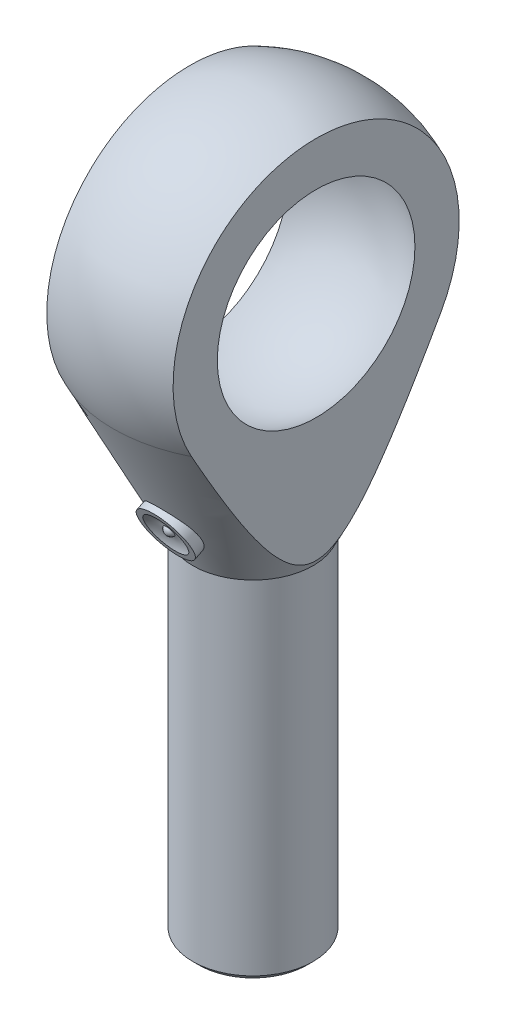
ISO-10303-21;
HEADER;
FILE_DESCRIPTION(('STEP AP214'),'2;1');
FILE_NAME('part.step','',(''),(''),'','','');
FILE_SCHEMA(('AUTOMOTIVE_DESIGN { 1 0 10303 214 1 1 1 1 }'));
ENDSEC;
DATA;
#1=APPLICATION_CONTEXT('core data for automotive mechanical design processes');
#2=APPLICATION_PROTOCOL_DEFINITION('international standard','automotive_design',2000,#1);
#3=PRODUCT_CONTEXT('',#1,'mechanical');
#4=PRODUCT('Part','Part','',(#3));
#5=PRODUCT_RELATED_PRODUCT_CATEGORY('part','',(#4));
#6=PRODUCT_DEFINITION_FORMATION('','',#4);
#7=PRODUCT_DEFINITION_CONTEXT('part definition',#1,'design');
#8=PRODUCT_DEFINITION('design','',#6,#7);
#9=PRODUCT_DEFINITION_SHAPE('','',#8);
#10=(LENGTH_UNIT() NAMED_UNIT(*) SI_UNIT(.MILLI.,.METRE.));
#11=(NAMED_UNIT(*) PLANE_ANGLE_UNIT() SI_UNIT($,.RADIAN.));
#12=(NAMED_UNIT(*) SI_UNIT($,.STERADIAN.) SOLID_ANGLE_UNIT());
#13=UNCERTAINTY_MEASURE_WITH_UNIT(LENGTH_MEASURE(1.E-05),#10,'distance_accuracy_value','');
#14=(GEOMETRIC_REPRESENTATION_CONTEXT(3) GLOBAL_UNCERTAINTY_ASSIGNED_CONTEXT((#13)) GLOBAL_UNIT_ASSIGNED_CONTEXT((#10,
#11,#12)) REPRESENTATION_CONTEXT('',''));
#15=CARTESIAN_POINT('',(0.,0.,0.));
#16=DIRECTION('',(0.,0.,1.));
#17=DIRECTION('',(1.,0.,0.));
#18=AXIS2_PLACEMENT_3D('',#15,#16,#17);
#19=CARTESIAN_POINT('',(0.,-19.,0.));
#20=DIRECTION('',(0.,1.,0.));
#21=DIRECTION('',(0.,0.,1.));
#22=AXIS2_PLACEMENT_3D('',#19,#20,#21);
#23=CONICAL_SURFACE('',#22,5.,0.465736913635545);
#24=CARTESIAN_POINT('',(-5.25,34.8684426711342,-31.6424798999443));
#25=CARTESIAN_POINT('',(-5.25,33.2094426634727,-30.7972062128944));
#26=CARTESIAN_POINT('',(-5.25,31.5507803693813,-29.951268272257));
#27=CARTESIAN_POINT('',(-5.25,28.2343943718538,-28.2575243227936));
#28=CARTESIAN_POINT('',(-5.25,26.5766706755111,-27.4097183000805));
#29=CARTESIAN_POINT('',(-5.25,23.2617657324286,-25.7113607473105));
#30=CARTESIAN_POINT('',(-5.25,21.6045849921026,-24.8608082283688));
#31=CARTESIAN_POINT('',(-5.25,18.2919007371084,-23.1564653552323));
#32=CARTESIAN_POINT('',(-5.25,16.6363972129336,-22.3026750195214));
#33=CARTESIAN_POINT('',(-5.25,13.3591181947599,-20.6068440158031));
#34=CARTESIAN_POINT('',(-5.25,11.7372989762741,-19.7648879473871));
#35=CARTESIAN_POINT('',(-5.25,9.30701714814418,-18.4972267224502));
#36=CARTESIAN_POINT('',(-5.25,8.49732379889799,-18.0738813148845));
#37=CARTESIAN_POINT('',(-5.25,6.87895683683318,-17.2252463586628));
#38=CARTESIAN_POINT('',(-5.25,6.07028322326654,-16.7999568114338));
#39=CARTESIAN_POINT('',(-5.25,4.45441052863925,-15.947068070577));
#40=CARTESIAN_POINT('',(-5.25,3.64721113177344,-15.5194694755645));
#41=CARTESIAN_POINT('',(-5.25,2.03444060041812,-14.6612141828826));
#42=CARTESIAN_POINT('',(-5.25,1.22886946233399,-14.230557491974));
#43=CARTESIAN_POINT('',(-5.25,-0.380121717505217,-13.3652946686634));
#44=CARTESIAN_POINT('',(-5.25,-1.18354181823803,-12.9306886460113));
#45=CARTESIAN_POINT('',(-5.25,-2.78751936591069,-12.0562300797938));
#46=CARTESIAN_POINT('',(-5.25,-3.58807683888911,-11.6163775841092));
#47=CARTESIAN_POINT('',(-5.25,-4.75989727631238,-10.9656125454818));
#48=CARTESIAN_POINT('',(-5.25,-5.13273040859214,-10.7575271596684));
#49=CARTESIAN_POINT('',(-5.25,-5.87734752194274,-10.3394833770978));
#50=CARTESIAN_POINT('',(-5.25,-6.24913149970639,-10.1295249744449));
#51=CARTESIAN_POINT('',(-5.25,-6.99154138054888,-9.70732959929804));
#52=CARTESIAN_POINT('',(-5.25,-7.3621669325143,-9.49509200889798));
#53=CARTESIAN_POINT('',(-5.25,-8.10187662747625,-9.06794841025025));
#54=CARTESIAN_POINT('',(-5.25,-8.4709607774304,-8.85304241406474));
#55=CARTESIAN_POINT('',(-5.25,-9.21045644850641,-8.41807751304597));
#56=CARTESIAN_POINT('',(-5.25,-9.58085111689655,-8.19798991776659));
#57=CARTESIAN_POINT('',(-5.25,-10.3191771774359,-7.75372123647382));
#58=CARTESIAN_POINT('',(-5.25,-10.6871085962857,-7.52954019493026));
#59=CARTESIAN_POINT('',(-5.25,-11.4195455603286,-7.0761504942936));
#60=CARTESIAN_POINT('',(-5.25,-11.7840531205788,-6.84694509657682));
#61=CARTESIAN_POINT('',(-5.25,-12.5088011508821,-6.38189138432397));
#62=CARTESIAN_POINT('',(-5.25,-12.8690418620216,-6.14604344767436));
#63=CARTESIAN_POINT('',(-5.25,-13.4171978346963,-5.77739604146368));
#64=CARTESIAN_POINT('',(-5.25,-13.6072378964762,-5.64775635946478));
#65=CARTESIAN_POINT('',(-5.25,-13.9852402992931,-5.38548642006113));
#66=CARTESIAN_POINT('',(-5.25,-14.1732026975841,-5.25285624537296));
#67=CARTESIAN_POINT('',(-5.25,-14.5468858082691,-4.98380606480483));
#68=CARTESIAN_POINT('',(-5.25,-14.7326021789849,-4.84738001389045));
#69=CARTESIAN_POINT('',(-5.25,-15.1007882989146,-4.57022584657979));
#70=CARTESIAN_POINT('',(-5.25,-15.2832582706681,-4.42949802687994));
#71=CARTESIAN_POINT('',(-5.25,-15.6422165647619,-4.14421618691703));
#72=CARTESIAN_POINT('',(-5.25,-15.8187465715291,-3.99971483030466));
#73=CARTESIAN_POINT('',(-5.25,-16.1664748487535,-3.70427773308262));
#74=CARTESIAN_POINT('',(-5.25,-16.3376713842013,-3.55333993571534));
#75=CARTESIAN_POINT('',(-5.25,-16.6722335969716,-3.24389491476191));
#76=CARTESIAN_POINT('',(-5.25,-16.8356199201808,-3.08541014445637));
#77=CARTESIAN_POINT('',(-5.25,-17.1519941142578,-2.75844697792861));
#78=CARTESIAN_POINT('',(-5.25,-17.3049907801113,-2.58997726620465));
#79=CARTESIAN_POINT('',(-5.25,-17.5152880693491,-2.33703604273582));
#80=CARTESIAN_POINT('',(-5.25,-17.5787096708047,-2.25764863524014));
#81=CARTESIAN_POINT('',(-5.25,-17.7018702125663,-2.09603810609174));
#82=CARTESIAN_POINT('',(-5.25,-17.7616086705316,-2.01381461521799));
#83=CARTESIAN_POINT('',(-5.25,-17.8767285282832,-1.84612002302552));
#84=CARTESIAN_POINT('',(-5.25,-17.9321019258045,-1.7606433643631));
#85=CARTESIAN_POINT('',(-5.25,-18.0373835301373,-1.586425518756));
#86=CARTESIAN_POINT('',(-5.25,-18.0872915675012,-1.49768423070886));
#87=CARTESIAN_POINT('',(-5.25,-18.228682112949,-1.22311710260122));
#88=CARTESIAN_POINT('',(-5.25,-18.309929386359,-1.03159315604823));
#89=CARTESIAN_POINT('',(-5.25,-18.4023527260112,-0.735584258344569));
#90=CARTESIAN_POINT('',(-5.25,-18.4282366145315,-0.635608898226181));
#91=CARTESIAN_POINT('',(-5.25,-18.4689732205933,-0.433403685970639));
#92=CARTESIAN_POINT('',(-5.25,-18.483829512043,-0.331174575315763));
#93=CARTESIAN_POINT('',(-5.25,-18.5005113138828,-0.138345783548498));
#94=CARTESIAN_POINT('',(-5.25,-18.5037159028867,-0.0478638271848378));
#95=CARTESIAN_POINT('',(-5.25,-18.5007998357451,0.132943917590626));
#96=CARTESIAN_POINT('',(-5.25,-18.4946799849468,0.223269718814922));
#97=CARTESIAN_POINT('',(-5.25,-18.4733972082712,0.402982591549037));
#98=CARTESIAN_POINT('',(-5.25,-18.4582201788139,0.492367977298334));
#99=CARTESIAN_POINT('',(-5.25,-18.4195200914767,0.669288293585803));
#100=CARTESIAN_POINT('',(-5.25,-18.3959954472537,0.756822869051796));
#101=CARTESIAN_POINT('',(-5.25,-18.3035909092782,1.04963639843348));
#102=CARTESIAN_POINT('',(-5.25,-18.2171126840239,1.2494952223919));
#103=CARTESIAN_POINT('',(-5.25,-18.0656290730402,1.53720309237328));
#104=CARTESIAN_POINT('',(-5.25,-18.0114085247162,1.63122497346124));
#105=CARTESIAN_POINT('',(-5.25,-17.8969897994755,1.81559205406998));
#106=CARTESIAN_POINT('',(-5.25,-17.83679228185,1.90593765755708));
#107=CARTESIAN_POINT('',(-5.25,-17.689038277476,2.11505617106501));
#108=CARTESIAN_POINT('',(-5.25,-17.5994289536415,2.23236605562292));
#109=CARTESIAN_POINT('',(-5.25,-17.4133884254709,2.4614833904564));
#110=CARTESIAN_POINT('',(-5.25,-17.3169539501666,2.57328815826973));
#111=CARTESIAN_POINT('',(-5.25,-17.1186654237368,2.79231361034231));
#112=CARTESIAN_POINT('',(-5.25,-17.0168020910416,2.89952583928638));
#113=CARTESIAN_POINT('',(-5.25,-16.8089315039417,3.10986043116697));
#114=CARTESIAN_POINT('',(-5.25,-16.7029237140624,3.21298226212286));
#115=CARTESIAN_POINT('',(-5.25,-16.4868365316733,3.41643433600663));
#116=CARTESIAN_POINT('',(-5.25,-16.3767333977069,3.51673926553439));
#117=CARTESIAN_POINT('',(-5.25,-16.153811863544,3.71428260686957));
#118=CARTESIAN_POINT('',(-5.25,-16.0409933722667,3.81152091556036));
#119=CARTESIAN_POINT('',(-5.25,-15.813265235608,4.00322768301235));
#120=CARTESIAN_POINT('',(-5.25,-15.6983582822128,4.09769934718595));
#121=CARTESIAN_POINT('',(-5.25,-15.4666941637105,4.28433125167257));
#122=CARTESIAN_POINT('',(-5.25,-15.3499370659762,4.37649157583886));
#123=CARTESIAN_POINT('',(-5.25,-14.9700451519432,4.67112941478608));
#124=CARTESIAN_POINT('',(-5.25,-14.7038123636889,4.86961583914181));
#125=CARTESIAN_POINT('',(-5.25,-14.1658690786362,5.25904523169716));
#126=CARTESIAN_POINT('',(-5.25,-13.89415771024,5.44998698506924));
#127=CARTESIAN_POINT('',(-5.25,-13.3465605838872,5.82606562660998));
#128=CARTESIAN_POINT('',(-5.25,-13.0706728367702,6.01119961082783));
#129=CARTESIAN_POINT('',(-5.25,-12.5158071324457,6.37678065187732));
#130=CARTESIAN_POINT('',(-5.25,-12.2368290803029,6.55722756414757));
#131=CARTESIAN_POINT('',(-5.25,-11.6758942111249,6.91468303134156));
#132=CARTESIAN_POINT('',(-5.25,-11.3939325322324,7.09168394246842));
#133=CARTESIAN_POINT('',(-5.25,-10.8280628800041,7.44254904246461));
#134=CARTESIAN_POINT('',(-5.25,-10.5441548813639,7.61641319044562));
#135=CARTESIAN_POINT('',(-5.25,-9.69024876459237,8.13400773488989));
#136=CARTESIAN_POINT('',(-5.25,-9.11789444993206,8.47385013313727));
#137=CARTESIAN_POINT('',(-5.25,-7.97004092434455,9.145428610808));
#138=CARTESIAN_POINT('',(-5.25,-7.39455053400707,9.47717984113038));
#139=CARTESIAN_POINT('',(-5.25,-6.24038506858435,10.1351838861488));
#140=CARTESIAN_POINT('',(-5.25,-5.66170977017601,10.4614363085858));
#141=CARTESIAN_POINT('',(-5.25,-4.50269693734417,11.1093171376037));
#142=CARTESIAN_POINT('',(-5.25,-3.92236225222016,11.4309506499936));
#143=CARTESIAN_POINT('',(-5.25,-2.75988076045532,12.0708885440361));
#144=CARTESIAN_POINT('',(-5.25,-2.17773399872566,12.3891930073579));
#145=CARTESIAN_POINT('',(-5.25,-0.629376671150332,13.2312444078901));
#146=CARTESIAN_POINT('',(-5.25,0.338086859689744,13.752686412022));
#147=CARTESIAN_POINT('',(-5.25,2.27578641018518,14.7903974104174));
#148=CARTESIAN_POINT('',(-5.25,3.2460224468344,15.3066663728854));
#149=CARTESIAN_POINT('',(-5.25,5.18855936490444,16.3353643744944));
#150=CARTESIAN_POINT('',(-5.25,6.16086029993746,16.8477933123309));
#151=CARTESIAN_POINT('',(-5.25,8.10700681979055,17.8697100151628));
#152=CARTESIAN_POINT('',(-5.25,9.08085240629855,18.3791977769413));
#153=CARTESIAN_POINT('',(-5.25,11.0303341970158,19.3961831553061));
#154=CARTESIAN_POINT('',(-5.25,12.0059711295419,19.9036793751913));
#155=CARTESIAN_POINT('',(-5.25,13.9581986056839,20.9168348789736));
#156=CARTESIAN_POINT('',(-5.25,14.9347891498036,21.4224941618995));
#157=CARTESIAN_POINT('',(-5.25,17.8656758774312,22.9372460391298));
#158=CARTESIAN_POINT('',(-5.25,19.8211149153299,23.9441271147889));
#159=CARTESIAN_POINT('',(-5.25,23.7151250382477,25.9441629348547));
#160=CARTESIAN_POINT('',(-5.25,25.6536763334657,26.9373562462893));
#161=CARTESIAN_POINT('',(-5.25,29.532235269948,28.9209160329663));
#162=CARTESIAN_POINT('',(-5.25,31.4722429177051,29.9112824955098));
#163=CARTESIAN_POINT('',(-5.25,35.3519314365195,31.889216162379));
#164=CARTESIAN_POINT('',(-5.25,37.2916115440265,32.8767848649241));
#165=CARTESIAN_POINT('',(-5.25,41.1717855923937,34.8502960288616));
#166=CARTESIAN_POINT('',(-5.25,43.1122795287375,35.8362384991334));
#167=CARTESIAN_POINT('',(-5.25,45.0530661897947,36.8216034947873));
#168=B_SPLINE_CURVE_WITH_KNOTS('',3,(#24,#25,#26,#27,#28,#29,#30,#31,#32,#33,#34,#35,#36,#37,
#38,#39,#40,#41,#42,#43,#44,#45,#46,#47,#48,#49,#50,#51,#52,#53,#54,#55,#56,#57,#58,#59,#60,#61,
#62,#63,#64,#65,#66,#67,#68,#69,#70,#71,#72,#73,#74,#75,#76,#77,#78,#79,#80,#81,#82,#83,#84,#85,
#86,#87,#88,#89,#90,#91,#92,#93,#94,#95,#96,#97,#98,#99,#100,#101,#102,#103,#104,#105,#106,#107,
#108,#109,#110,#111,#112,#113,#114,#115,#116,#117,#118,#119,#120,#121,#122,#123,#124,#125,#126,
#127,#128,#129,#130,#131,#132,#133,#134,#135,#136,#137,#138,#139,#140,#141,#142,#143,#144,#145,
#146,#147,#148,#149,#150,#151,#152,#153,#154,#155,#156,#157,#158,#159,#160,#161,#162,#163,#164,
#165,#166,#167),.UNSPECIFIED.,.F.,.F.,(4,2,2,2,2,2,2,2,2,2,2,2,2,2,2,2,2,2,2,2,2,2,2,2,2,2,2,2,
2,2,2,2,2,2,2,2,2,2,2,2,2,2,2,2,2,2,2,2,2,2,2,2,2,2,2,2,2,2,2,2,2,2,2,2,2,2,2,2,2,2,2,4),(0.,
5.58577897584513,11.1715996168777,16.7597261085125,22.347820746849,27.8298429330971,
30.5709031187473,33.3119612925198,36.0523400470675,38.7927127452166,41.5330095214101,
44.2732813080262,45.5541895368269,46.8351017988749,48.1163705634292,49.3976335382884,
50.6901596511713,51.9826717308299,53.2743683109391,54.5659915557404,55.2561104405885,
55.9462102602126,56.6374802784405,57.3287027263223,58.0129787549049,58.6974751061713,
59.3800487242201,60.0620371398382,60.3667823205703,60.6715673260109,60.9768986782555,
61.2822394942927,61.9026265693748,62.2119430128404,62.5211591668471,62.7923069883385,
63.0634313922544,63.334979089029,63.6065784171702,64.2556127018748,64.581113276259,
64.9065779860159,65.3491038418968,65.7918432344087,66.2353654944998,66.6789452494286,
67.1257050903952,67.572479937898,68.0187148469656,68.4649335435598,69.4609651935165,
70.4571565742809,71.4538383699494,72.450550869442,73.4492676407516,74.4479974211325,
76.4448394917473,78.4375995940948,80.4305012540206,82.4209975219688,84.4114448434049,
87.7085380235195,91.0056514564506,94.3028515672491,97.6000552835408,100.899261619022,
104.198469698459,110.796791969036,117.331292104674,123.865821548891,130.395664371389,
136.925471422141),.UNSPECIFIED.);
#169=CARTESIAN_POINT('',(-5.25,-5.83805753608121,-10.3612057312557));
#170=VERTEX_POINT('',#169);
#171=CARTESIAN_POINT('',(-5.25,-5.83805753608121,10.3612057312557));
#172=VERTEX_POINT('',#171);
#173=EDGE_CURVE('E58',#170,#172,#168,.T.);
#174=ORIENTED_EDGE('',*,*,#173,.F.);
#175=CARTESIAN_POINT('',(0.,-5.83805753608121,0.));
#176=DIRECTION('',(0.,1.,0.));
#177=DIRECTION('',(0.,0.,1.));
#178=AXIS2_PLACEMENT_3D('',#175,#176,#177);
#179=CIRCLE('',#178,11.6153813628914);
#180=CARTESIAN_POINT('',(5.25,-5.83805753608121,-10.3612057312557));
#181=VERTEX_POINT('',#180);
#182=EDGE_CURVE('E66',#181,#170,#179,.T.);
#183=ORIENTED_EDGE('',*,*,#182,.F.);
#184=CARTESIAN_POINT('',(5.25,34.8684426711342,-31.6424798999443));
#185=CARTESIAN_POINT('',(5.25,33.2094426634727,-30.7972062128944));
#186=CARTESIAN_POINT('',(5.25,31.5507803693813,-29.951268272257));
#187=CARTESIAN_POINT('',(5.25,28.2343943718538,-28.2575243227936));
#188=CARTESIAN_POINT('',(5.25,26.5766706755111,-27.4097183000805));
#189=CARTESIAN_POINT('',(5.25,23.2617657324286,-25.7113607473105));
#190=CARTESIAN_POINT('',(5.25,21.6045849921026,-24.8608082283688));
#191=CARTESIAN_POINT('',(5.25,18.2919007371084,-23.1564653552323));
#192=CARTESIAN_POINT('',(5.25,16.6363972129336,-22.3026750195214));
#193=CARTESIAN_POINT('',(5.25,13.3591181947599,-20.6068440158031));
#194=CARTESIAN_POINT('',(5.25,11.7372989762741,-19.7648879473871));
#195=CARTESIAN_POINT('',(5.25,9.30701714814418,-18.4972267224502));
#196=CARTESIAN_POINT('',(5.25,8.49732379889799,-18.0738813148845));
#197=CARTESIAN_POINT('',(5.25,6.87895683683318,-17.2252463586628));
#198=CARTESIAN_POINT('',(5.25,6.07028322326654,-16.7999568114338));
#199=CARTESIAN_POINT('',(5.25,4.45441052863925,-15.947068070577));
#200=CARTESIAN_POINT('',(5.25,3.64721113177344,-15.5194694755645));
#201=CARTESIAN_POINT('',(5.25,2.03444060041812,-14.6612141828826));
#202=CARTESIAN_POINT('',(5.25,1.22886946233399,-14.230557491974));
#203=CARTESIAN_POINT('',(5.25,-0.380121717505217,-13.3652946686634));
#204=CARTESIAN_POINT('',(5.25,-1.18354181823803,-12.9306886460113));
#205=CARTESIAN_POINT('',(5.25,-2.78751936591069,-12.0562300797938));
#206=CARTESIAN_POINT('',(5.25,-3.58807683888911,-11.6163775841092));
#207=CARTESIAN_POINT('',(5.25,-4.75989727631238,-10.9656125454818));
#208=CARTESIAN_POINT('',(5.25,-5.13273040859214,-10.7575271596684));
#209=CARTESIAN_POINT('',(5.25,-5.87734752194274,-10.3394833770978));
#210=CARTESIAN_POINT('',(5.25,-6.24913149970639,-10.1295249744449));
#211=CARTESIAN_POINT('',(5.25,-6.99154138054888,-9.70732959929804));
#212=CARTESIAN_POINT('',(5.25,-7.3621669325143,-9.49509200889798));
#213=CARTESIAN_POINT('',(5.25,-8.10187662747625,-9.06794841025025));
#214=CARTESIAN_POINT('',(5.25,-8.4709607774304,-8.85304241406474));
#215=CARTESIAN_POINT('',(5.25,-9.21045644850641,-8.41807751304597));
#216=CARTESIAN_POINT('',(5.25,-9.58085111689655,-8.19798991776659));
#217=CARTESIAN_POINT('',(5.25,-10.3191771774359,-7.75372123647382));
#218=CARTESIAN_POINT('',(5.25,-10.6871085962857,-7.52954019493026));
#219=CARTESIAN_POINT('',(5.25,-11.4195455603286,-7.0761504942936));
#220=CARTESIAN_POINT('',(5.25,-11.7840531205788,-6.84694509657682));
#221=CARTESIAN_POINT('',(5.25,-12.5088011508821,-6.38189138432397));
#222=CARTESIAN_POINT('',(5.25,-12.8690418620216,-6.14604344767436));
#223=CARTESIAN_POINT('',(5.25,-13.4171978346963,-5.77739604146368));
#224=CARTESIAN_POINT('',(5.25,-13.6072378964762,-5.64775635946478));
#225=CARTESIAN_POINT('',(5.25,-13.9852402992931,-5.38548642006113));
#226=CARTESIAN_POINT('',(5.25,-14.1732026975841,-5.25285624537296));
#227=CARTESIAN_POINT('',(5.25,-14.5468858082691,-4.98380606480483));
#228=CARTESIAN_POINT('',(5.25,-14.7326021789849,-4.84738001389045));
#229=CARTESIAN_POINT('',(5.25,-15.1007882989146,-4.57022584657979));
#230=CARTESIAN_POINT('',(5.25,-15.2832582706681,-4.42949802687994));
#231=CARTESIAN_POINT('',(5.25,-15.6422165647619,-4.14421618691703));
#232=CARTESIAN_POINT('',(5.25,-15.8187465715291,-3.99971483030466));
#233=CARTESIAN_POINT('',(5.25,-16.1664748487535,-3.70427773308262));
#234=CARTESIAN_POINT('',(5.25,-16.3376713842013,-3.55333993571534));
#235=CARTESIAN_POINT('',(5.25,-16.6722335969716,-3.24389491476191));
#236=CARTESIAN_POINT('',(5.25,-16.8356199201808,-3.08541014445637));
#237=CARTESIAN_POINT('',(5.25,-17.1519941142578,-2.75844697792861));
#238=CARTESIAN_POINT('',(5.25,-17.3049907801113,-2.58997726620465));
#239=CARTESIAN_POINT('',(5.25,-17.5152880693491,-2.33703604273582));
#240=CARTESIAN_POINT('',(5.25,-17.5787096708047,-2.25764863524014));
#241=CARTESIAN_POINT('',(5.25,-17.7018702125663,-2.09603810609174));
#242=CARTESIAN_POINT('',(5.25,-17.7616086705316,-2.01381461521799));
#243=CARTESIAN_POINT('',(5.25,-17.8767285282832,-1.84612002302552));
#244=CARTESIAN_POINT('',(5.25,-17.9321019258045,-1.7606433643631));
#245=CARTESIAN_POINT('',(5.25,-18.0373835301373,-1.586425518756));
#246=CARTESIAN_POINT('',(5.25,-18.0872915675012,-1.49768423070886));
#247=CARTESIAN_POINT('',(5.25,-18.228682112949,-1.22311710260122));
#248=CARTESIAN_POINT('',(5.25,-18.309929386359,-1.03159315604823));
#249=CARTESIAN_POINT('',(5.25,-18.4023527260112,-0.735584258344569));
#250=CARTESIAN_POINT('',(5.25,-18.4282366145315,-0.635608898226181));
#251=CARTESIAN_POINT('',(5.25,-18.4689732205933,-0.433403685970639));
#252=CARTESIAN_POINT('',(5.25,-18.483829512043,-0.331174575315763));
#253=CARTESIAN_POINT('',(5.25,-18.5005113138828,-0.138345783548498));
#254=CARTESIAN_POINT('',(5.25,-18.5037159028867,-0.0478638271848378));
#255=CARTESIAN_POINT('',(5.25,-18.5007998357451,0.132943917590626));
#256=CARTESIAN_POINT('',(5.25,-18.4946799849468,0.223269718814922));
#257=CARTESIAN_POINT('',(5.25,-18.4733972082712,0.402982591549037));
#258=CARTESIAN_POINT('',(5.25,-18.4582201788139,0.492367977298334));
#259=CARTESIAN_POINT('',(5.25,-18.4195200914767,0.669288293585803));
#260=CARTESIAN_POINT('',(5.25,-18.3959954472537,0.756822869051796));
#261=CARTESIAN_POINT('',(5.25,-18.3035909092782,1.04963639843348));
#262=CARTESIAN_POINT('',(5.25,-18.2171126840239,1.2494952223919));
#263=CARTESIAN_POINT('',(5.25,-18.0656290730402,1.53720309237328));
#264=CARTESIAN_POINT('',(5.25,-18.0114085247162,1.63122497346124));
#265=CARTESIAN_POINT('',(5.25,-17.8969897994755,1.81559205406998));
#266=CARTESIAN_POINT('',(5.25,-17.83679228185,1.90593765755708));
#267=CARTESIAN_POINT('',(5.25,-17.689038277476,2.11505617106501));
#268=CARTESIAN_POINT('',(5.25,-17.5994289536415,2.23236605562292));
#269=CARTESIAN_POINT('',(5.25,-17.4133884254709,2.4614833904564));
#270=CARTESIAN_POINT('',(5.25,-17.3169539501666,2.57328815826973));
#271=CARTESIAN_POINT('',(5.25,-17.1186654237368,2.79231361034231));
#272=CARTESIAN_POINT('',(5.25,-17.0168020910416,2.89952583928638));
#273=CARTESIAN_POINT('',(5.25,-16.8089315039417,3.10986043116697));
#274=CARTESIAN_POINT('',(5.25,-16.7029237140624,3.21298226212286));
#275=CARTESIAN_POINT('',(5.25,-16.4868365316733,3.41643433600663));
#276=CARTESIAN_POINT('',(5.25,-16.3767333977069,3.51673926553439));
#277=CARTESIAN_POINT('',(5.25,-16.153811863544,3.71428260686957));
#278=CARTESIAN_POINT('',(5.25,-16.0409933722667,3.81152091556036));
#279=CARTESIAN_POINT('',(5.25,-15.813265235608,4.00322768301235));
#280=CARTESIAN_POINT('',(5.25,-15.6983582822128,4.09769934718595));
#281=CARTESIAN_POINT('',(5.25,-15.4666941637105,4.28433125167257));
#282=CARTESIAN_POINT('',(5.25,-15.3499370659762,4.37649157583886));
#283=CARTESIAN_POINT('',(5.25,-14.9700451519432,4.67112941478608));
#284=CARTESIAN_POINT('',(5.25,-14.7038123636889,4.86961583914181));
#285=CARTESIAN_POINT('',(5.25,-14.1658690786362,5.25904523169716));
#286=CARTESIAN_POINT('',(5.25,-13.89415771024,5.44998698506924));
#287=CARTESIAN_POINT('',(5.25,-13.3465605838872,5.82606562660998));
#288=CARTESIAN_POINT('',(5.25,-13.0706728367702,6.01119961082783));
#289=CARTESIAN_POINT('',(5.25,-12.5158071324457,6.37678065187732));
#290=CARTESIAN_POINT('',(5.25,-12.2368290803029,6.55722756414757));
#291=CARTESIAN_POINT('',(5.25,-11.6758942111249,6.91468303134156));
#292=CARTESIAN_POINT('',(5.25,-11.3939325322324,7.09168394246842));
#293=CARTESIAN_POINT('',(5.25,-10.8280628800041,7.44254904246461));
#294=CARTESIAN_POINT('',(5.25,-10.5441548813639,7.61641319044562));
#295=CARTESIAN_POINT('',(5.25,-9.69024876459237,8.13400773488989));
#296=CARTESIAN_POINT('',(5.25,-9.11789444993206,8.47385013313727));
#297=CARTESIAN_POINT('',(5.25,-7.97004092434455,9.145428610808));
#298=CARTESIAN_POINT('',(5.25,-7.39455053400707,9.47717984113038));
#299=CARTESIAN_POINT('',(5.25,-6.24038506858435,10.1351838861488));
#300=CARTESIAN_POINT('',(5.25,-5.66170977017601,10.4614363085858));
#301=CARTESIAN_POINT('',(5.25,-4.50269693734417,11.1093171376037));
#302=CARTESIAN_POINT('',(5.25,-3.92236225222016,11.4309506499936));
#303=CARTESIAN_POINT('',(5.25,-2.75988076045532,12.0708885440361));
#304=CARTESIAN_POINT('',(5.25,-2.17773399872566,12.3891930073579));
#305=CARTESIAN_POINT('',(5.25,-0.629376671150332,13.2312444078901));
#306=CARTESIAN_POINT('',(5.25,0.338086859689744,13.752686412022));
#307=CARTESIAN_POINT('',(5.25,2.27578641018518,14.7903974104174));
#308=CARTESIAN_POINT('',(5.25,3.2460224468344,15.3066663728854));
#309=CARTESIAN_POINT('',(5.25,5.18855936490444,16.3353643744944));
#310=CARTESIAN_POINT('',(5.25,6.16086029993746,16.8477933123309));
#311=CARTESIAN_POINT('',(5.25,8.10700681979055,17.8697100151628));
#312=CARTESIAN_POINT('',(5.25,9.08085240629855,18.3791977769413));
#313=CARTESIAN_POINT('',(5.25,11.0303341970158,19.3961831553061));
#314=CARTESIAN_POINT('',(5.25,12.0059711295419,19.9036793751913));
#315=CARTESIAN_POINT('',(5.25,13.9581986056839,20.9168348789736));
#316=CARTESIAN_POINT('',(5.25,14.9347891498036,21.4224941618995));
#317=CARTESIAN_POINT('',(5.25,17.8656758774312,22.9372460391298));
#318=CARTESIAN_POINT('',(5.25,19.8211149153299,23.9441271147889));
#319=CARTESIAN_POINT('',(5.25,23.7151250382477,25.9441629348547));
#320=CARTESIAN_POINT('',(5.25,25.6536763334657,26.9373562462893));
#321=CARTESIAN_POINT('',(5.25,29.532235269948,28.9209160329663));
#322=CARTESIAN_POINT('',(5.25,31.4722429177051,29.9112824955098));
#323=CARTESIAN_POINT('',(5.25,35.3519314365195,31.889216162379));
#324=CARTESIAN_POINT('',(5.25,37.2916115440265,32.8767848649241));
#325=CARTESIAN_POINT('',(5.25,41.1717855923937,34.8502960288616));
#326=CARTESIAN_POINT('',(5.25,43.1122795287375,35.8362384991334));
#327=CARTESIAN_POINT('',(5.25,45.0530661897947,36.8216034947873));
#328=B_SPLINE_CURVE_WITH_KNOTS('',3,(#184,#185,#186,#187,#188,#189,#190,#191,#192,#193,#194,
#195,#196,#197,#198,#199,#200,#201,#202,#203,#204,#205,#206,#207,#208,#209,#210,#211,#212,#213,
#214,#215,#216,#217,#218,#219,#220,#221,#222,#223,#224,#225,#226,#227,#228,#229,#230,#231,#232,
#233,#234,#235,#236,#237,#238,#239,#240,#241,#242,#243,#244,#245,#246,#247,#248,#249,#250,#251,
#252,#253,#254,#255,#256,#257,#258,#259,#260,#261,#262,#263,#264,#265,#266,#267,#268,#269,#270,
#271,#272,#273,#274,#275,#276,#277,#278,#279,#280,#281,#282,#283,#284,#285,#286,#287,#288,#289,
#290,#291,#292,#293,#294,#295,#296,#297,#298,#299,#300,#301,#302,#303,#304,#305,#306,#307,#308,
#309,#310,#311,#312,#313,#314,#315,#316,#317,#318,#319,#320,#321,#322,#323,#324,#325,#326,#327),
.UNSPECIFIED.,.F.,.F.,(4,2,2,2,2,2,2,2,2,2,2,2,2,2,2,2,2,2,2,2,2,2,2,2,2,2,2,2,2,2,2,2,2,2,2,2,
2,2,2,2,2,2,2,2,2,2,2,2,2,2,2,2,2,2,2,2,2,2,2,2,2,2,2,2,2,2,2,2,2,2,2,4),(0.,5.58577897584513,
11.1715996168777,16.7597261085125,22.347820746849,27.8298429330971,30.5709031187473,
33.3119612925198,36.0523400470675,38.7927127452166,41.5330095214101,44.2732813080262,
45.5541895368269,46.8351017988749,48.1163705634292,49.3976335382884,50.6901596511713,
51.9826717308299,53.2743683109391,54.5659915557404,55.2561104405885,55.9462102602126,
56.6374802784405,57.3287027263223,58.0129787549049,58.6974751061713,59.3800487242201,
60.0620371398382,60.3667823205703,60.6715673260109,60.9768986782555,61.2822394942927,
61.9026265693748,62.2119430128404,62.5211591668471,62.7923069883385,63.0634313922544,
63.334979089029,63.6065784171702,64.2556127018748,64.581113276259,64.9065779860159,
65.3491038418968,65.7918432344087,66.2353654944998,66.6789452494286,67.1257050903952,
67.572479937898,68.0187148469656,68.4649335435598,69.4609651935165,70.4571565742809,
71.4538383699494,72.450550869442,73.4492676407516,74.4479974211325,76.4448394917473,
78.4375995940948,80.4305012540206,82.4209975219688,84.4114448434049,87.7085380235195,
91.0056514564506,94.3028515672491,97.6000552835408,100.899261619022,104.198469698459,
110.796791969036,117.331292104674,123.865821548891,130.395664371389,136.925471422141),.UNSPECIFIED.);
#329=CARTESIAN_POINT('',(5.25,-5.83805753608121,10.3612057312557));
#330=VERTEX_POINT('',#329);
#331=EDGE_CURVE('E64',#330,#181,#328,.F.);
#332=ORIENTED_EDGE('',*,*,#331,.F.);
#333=EDGE_CURVE('E52',#172,#330,#179,.T.);
#334=ORIENTED_EDGE('',*,*,#333,.F.);
#335=EDGE_LOOP('',(#174,#183,#332,#334));
#336=FACE_BOUND('',#335,.T.);
#337=CARTESIAN_POINT('',(0.,-19.,0.));
#338=DIRECTION('',(0.,1.,0.));
#339=DIRECTION('',(0.,0.,1.));
#340=AXIS2_PLACEMENT_3D('',#337,#338,#339);
#341=CIRCLE('',#340,5.);
#342=CARTESIAN_POINT('',(0.,-19.,5.));
#343=VERTEX_POINT('',#342);
#344=EDGE_CURVE('E72',#343,#343,#341,.T.);
#345=ORIENTED_EDGE('',*,*,#344,.T.);
#346=EDGE_LOOP('',(#345));
#347=FACE_BOUND('',#346,.T.);
#348=CARTESIAN_POINT('',(-1.47490473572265,-16.8632120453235,5.89218914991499));
#349=CARTESIAN_POINT('',(-1.38069918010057,-16.9452243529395,5.87327627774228));
#350=CARTESIAN_POINT('',(-1.27966179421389,-17.0202074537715,5.85779796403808));
#351=CARTESIAN_POINT('',(-1.06635595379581,-17.1532820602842,5.8323820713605));
#352=CARTESIAN_POINT('',(-0.954086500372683,-17.2113720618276,5.82244498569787));
#353=CARTESIAN_POINT('',(-0.720904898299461,-17.3082113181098,5.80685542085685));
#354=CARTESIAN_POINT('',(-0.599975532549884,-17.3469207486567,5.80121175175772));
#355=CARTESIAN_POINT('',(-0.353146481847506,-17.4028112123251,5.7933101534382));
#356=CARTESIAN_POINT('',(-0.227248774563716,-17.4200007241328,5.79105089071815));
#357=CARTESIAN_POINT('',(0.0208955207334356,-17.4316812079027,5.78950157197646));
#358=CARTESIAN_POINT('',(0.143103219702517,-17.4269946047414,5.79010394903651));
#359=CARTESIAN_POINT('',(0.384914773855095,-17.3970513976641,5.79414869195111));
#360=CARTESIAN_POINT('',(0.504518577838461,-17.3717943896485,5.7975911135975));
#361=CARTESIAN_POINT('',(0.736273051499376,-17.3024494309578,5.80784080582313));
#362=CARTESIAN_POINT('',(0.848499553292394,-17.2586067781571,5.81460442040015));
#363=CARTESIAN_POINT('',(1.06443302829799,-17.1540545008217,5.83239650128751));
#364=CARTESIAN_POINT('',(1.16813779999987,-17.0933405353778,5.84342606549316));
#365=CARTESIAN_POINT('',(1.36931391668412,-16.9541338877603,5.87151509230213));
#366=CARTESIAN_POINT('',(1.4662650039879,-16.8749410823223,5.88883303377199));
#367=CARTESIAN_POINT('',(1.64595973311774,-16.7034013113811,5.93067800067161));
#368=CARTESIAN_POINT('',(1.72870060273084,-16.6110517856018,5.95520643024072));
#369=CARTESIAN_POINT('',(1.87993200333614,-16.4134550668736,6.01336215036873));
#370=CARTESIAN_POINT('',(1.94795226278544,-16.3079165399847,6.04722758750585));
#371=CARTESIAN_POINT('',(2.06449797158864,-16.089721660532,6.1242833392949));
#372=CARTESIAN_POINT('',(2.11302930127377,-15.9770674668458,6.16747083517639));
#373=CARTESIAN_POINT('',(2.18758222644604,-15.7523396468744,6.26119332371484));
#374=CARTESIAN_POINT('',(2.21431286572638,-15.6403764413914,6.31142867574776));
#375=CARTESIAN_POINT('',(2.24703169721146,-15.4168465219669,6.41901043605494));
#376=CARTESIAN_POINT('',(2.25302314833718,-15.3052797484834,6.47635572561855));
#377=CARTESIAN_POINT('',(2.24426412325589,-15.0892572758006,6.59418722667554));
#378=CARTESIAN_POINT('',(2.23016492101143,-14.9846882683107,6.654516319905));
#379=CARTESIAN_POINT('',(2.18292759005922,-14.7814320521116,6.77756621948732));
#380=CARTESIAN_POINT('',(2.14978743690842,-14.6827454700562,6.84028727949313));
#381=CARTESIAN_POINT('',(2.06467522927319,-14.4914251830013,6.9668149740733));
#382=CARTESIAN_POINT('',(2.01234425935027,-14.3989494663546,7.03061859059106));
#383=CARTESIAN_POINT('',(1.89044913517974,-14.2239617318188,7.15537184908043));
#384=CARTESIAN_POINT('',(1.82088154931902,-14.1414517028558,7.21632091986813));
#385=CARTESIAN_POINT('',(1.66350177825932,-13.9850793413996,7.33486133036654));
#386=CARTESIAN_POINT('',(1.57512367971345,-13.9116344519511,7.3922532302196));
#387=CARTESIAN_POINT('',(1.38408023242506,-13.7783954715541,7.49849511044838));
#388=CARTESIAN_POINT('',(1.28141413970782,-13.7186020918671,7.54734464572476));
#389=CARTESIAN_POINT('',(1.06398262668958,-13.6136564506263,7.63431493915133));
#390=CARTESIAN_POINT('',(0.949162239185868,-13.5685748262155,7.67238382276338));
#391=CARTESIAN_POINT('',(0.711056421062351,-13.494511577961,7.73547875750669));
#392=CARTESIAN_POINT('',(0.587772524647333,-13.4655270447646,7.76050716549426));
#393=CARTESIAN_POINT('',(0.33970687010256,-13.4249428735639,7.7956783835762));
#394=CARTESIAN_POINT('',(0.215049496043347,-13.4129066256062,7.80619489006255));
#395=CARTESIAN_POINT('',(-0.0351509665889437,-13.4051206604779,7.81298925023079));
#396=CARTESIAN_POINT('',(-0.160693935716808,-13.4093687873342,7.80926898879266));
#397=CARTESIAN_POINT('',(-0.406464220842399,-13.433785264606,7.78801397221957));
#398=CARTESIAN_POINT('',(-0.526747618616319,-13.4536342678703,7.77075633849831));
#399=CARTESIAN_POINT('',(-0.761269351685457,-13.5083683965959,7.72365682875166));
#400=CARTESIAN_POINT('',(-0.875507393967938,-13.5432542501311,7.69381434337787));
#401=CARTESIAN_POINT('',(-1.09613237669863,-13.6277350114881,7.62262178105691));
#402=CARTESIAN_POINT('',(-1.20241920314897,-13.6774874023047,7.5811488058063));
#403=CARTESIAN_POINT('',(-1.40304632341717,-13.7905250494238,7.48880658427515));
#404=CARTESIAN_POINT('',(-1.49738451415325,-13.8538126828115,7.43793568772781));
#405=CARTESIAN_POINT('',(-1.67429091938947,-13.9947330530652,7.32752887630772));
#406=CARTESIAN_POINT('',(-1.75644487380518,-14.0727245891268,7.26778659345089));
#407=CARTESIAN_POINT('',(-1.90349580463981,-14.2403333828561,7.1435261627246));
#408=CARTESIAN_POINT('',(-1.96839079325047,-14.329951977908,7.07900746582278));
#409=CARTESIAN_POINT('',(-2.07961191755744,-14.5200276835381,6.9474846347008));
#410=CARTESIAN_POINT('',(-2.12575330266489,-14.6205808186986,6.88046255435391));
#411=CARTESIAN_POINT('',(-2.19703033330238,-14.8296214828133,6.74763093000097));
#412=CARTESIAN_POINT('',(-2.22217105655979,-14.9381070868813,6.68182109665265));
#413=CARTESIAN_POINT('',(-2.25008336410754,-15.1570885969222,6.5562140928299));
#414=CARTESIAN_POINT('',(-2.25347747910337,-15.2674369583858,6.4962984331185));
#415=CARTESIAN_POINT('',(-2.23935021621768,-15.4900010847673,6.38275367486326));
#416=CARTESIAN_POINT('',(-2.22183316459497,-15.6022164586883,6.32912327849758));
#417=CARTESIAN_POINT('',(-2.16735520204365,-15.8216495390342,6.23132871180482));
#418=CARTESIAN_POINT('',(-2.1310138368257,-15.9289143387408,6.18692264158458));
#419=CARTESIAN_POINT('',(-2.04046199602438,-16.1388360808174,6.10623021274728));
#420=CARTESIAN_POINT('',(-1.98625151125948,-16.2414930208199,6.06994385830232));
#421=CARTESIAN_POINT('',(-1.86331470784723,-16.4364139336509,6.00629166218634));
#422=CARTESIAN_POINT('',(-1.79503047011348,-16.5288865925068,5.97870719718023));
#423=CARTESIAN_POINT('',(-1.64478432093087,-16.7040188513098,5.93048014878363));
#424=CARTESIAN_POINT('',(-1.56281946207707,-16.7866763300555,5.90983906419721));
#425=CARTESIAN_POINT('',(-1.47490473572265,-16.8632120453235,5.89218914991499));
#426=B_SPLINE_CURVE_WITH_KNOTS('',3,(#348,#349,#350,#351,#352,#353,#354,#355,#356,#357,#358,
#359,#360,#361,#362,#363,#364,#365,#366,#367,#368,#369,#370,#371,#372,#373,#374,#375,#376,#377,
#378,#379,#380,#381,#382,#383,#384,#385,#386,#387,#388,#389,#390,#391,#392,#393,#394,#395,#396,
#397,#398,#399,#400,#401,#402,#403,#404,#405,#406,#407,#408,#409,#410,#411,#412,#413,#414,#415,
#416,#417,#418,#419,#420,#421,#422,#423,#424,#425),.UNSPECIFIED.,.T.,.F.,(4,2,2,2,2,2,2,2,2,2,2,
2,2,2,2,2,2,2,2,2,2,2,2,2,2,2,2,2,2,2,2,2,2,2,2,2,2,2,4),(0.,0.378579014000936,0.75719172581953,
1.1365792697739,1.51581729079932,1.88091531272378,2.24602050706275,2.60645003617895,
2.96697238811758,3.34439871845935,3.72189859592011,4.11009608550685,4.49817635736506,
4.87306563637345,5.24789600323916,5.61084837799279,5.9738393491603,6.34399757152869,
6.71422954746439,7.09776938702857,7.48132920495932,7.86670444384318,8.25201000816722,
8.62719574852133,9.00233181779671,9.36998280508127,9.73765159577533,10.1093622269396,
10.4811381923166,10.8635572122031,11.2460202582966,11.6321647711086,12.0182158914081,
12.3931643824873,12.7680353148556,13.1312861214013,13.4945371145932,13.847759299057,
14.2010576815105),.UNSPECIFIED.);
#427=CARTESIAN_POINT('',(-1.47490473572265,-16.8632120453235,5.89218914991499));
#428=VERTEX_POINT('',#427);
#429=EDGE_CURVE('E11',#428,#428,#426,.T.);
#430=ORIENTED_EDGE('',*,*,#429,.F.);
#431=EDGE_LOOP('',(#430));
#432=FACE_BOUND('',#431,.T.);
#433=ADVANCED_FACE('F28',(#336,#347,#432),#23,.T.);
#434=CARTESIAN_POINT('',(0.,0.,0.));
#435=DIRECTION('',(0.,1.,0.));
#436=DIRECTION('',(-1.,0.,0.));
#437=AXIS2_PLACEMENT_3D('',#434,#435,#436);
#438=SPHERICAL_SURFACE('',#437,13.);
#439=ORIENTED_EDGE('',*,*,#182,.T.);
#440=CARTESIAN_POINT('',(-5.25,0.,0.));
#441=DIRECTION('',(-1.,0.,0.));
#442=DIRECTION('',(0.,0.,1.));
#443=AXIS2_PLACEMENT_3D('',#440,#441,#442);
#444=CIRCLE('',#443,11.8927498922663);
#445=EDGE_CURVE('E45',#170,#172,#444,.F.);
#446=ORIENTED_EDGE('',*,*,#445,.T.);
#447=ORIENTED_EDGE('',*,*,#333,.T.);
#448=CARTESIAN_POINT('',(5.25,0.,0.));
#449=DIRECTION('',(1.,0.,0.));
#450=DIRECTION('',(0.,0.,-1.));
#451=AXIS2_PLACEMENT_3D('',#448,#449,#450);
#452=CIRCLE('',#451,11.8927498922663);
#453=EDGE_CURVE('E67',#330,#181,#452,.F.);
#454=ORIENTED_EDGE('',*,*,#453,.T.);
#455=EDGE_LOOP('',(#439,#446,#447,#454));
#456=FACE_BOUND('',#455,.T.);
#457=ADVANCED_FACE('F30',(#456),#438,.T.);
#458=CARTESIAN_POINT('',(0.,30.4749502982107,0.));
#459=DIRECTION('',(0.,1.,0.));
#460=DIRECTION('',(0.,0.,1.));
#461=AXIS2_PLACEMENT_3D('',#458,#459,#460);
#462=CYLINDRICAL_SURFACE('',#461,5.);
#463=CARTESIAN_POINT('',(0.,-47.5,0.));
#464=DIRECTION('',(0.,-1.,0.));
#465=DIRECTION('',(0.,0.,-1.));
#466=AXIS2_PLACEMENT_3D('',#463,#464,#465);
#467=CIRCLE('',#466,5.);
#468=CARTESIAN_POINT('',(0.,-47.5,-5.));
#469=VERTEX_POINT('',#468);
#470=EDGE_CURVE('E63',#469,#469,#467,.F.);
#471=ORIENTED_EDGE('',*,*,#470,.T.);
#472=EDGE_LOOP('',(#471));
#473=FACE_BOUND('',#472,.T.);
#474=ORIENTED_EDGE('',*,*,#344,.F.);
#475=EDGE_LOOP('',(#474));
#476=FACE_BOUND('',#475,.T.);
#477=ADVANCED_FACE('F93',(#473,#476),#462,.T.);
#478=CARTESIAN_POINT('',(-4.99999999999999,-48.,0.));
#479=DIRECTION('',(0.,-1.,0.));
#480=DIRECTION('',(0.,0.,-1.));
#481=AXIS2_PLACEMENT_3D('',#478,#479,#480);
#482=PLANE('',#481);
#483=CARTESIAN_POINT('',(0.,-48.,0.));
#484=DIRECTION('',(0.,-1.,0.));
#485=DIRECTION('',(0.,0.,-1.));
#486=AXIS2_PLACEMENT_3D('',#483,#484,#485);
#487=CIRCLE('',#486,4.49999999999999);
#488=CARTESIAN_POINT('',(0.,-48.,-4.49999999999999));
#489=VERTEX_POINT('',#488);
#490=EDGE_CURVE('E39',#489,#489,#487,.T.);
#491=ORIENTED_EDGE('',*,*,#490,.T.);
#492=EDGE_LOOP('',(#491));
#493=FACE_BOUND('',#492,.T.);
#494=ADVANCED_FACE('F97',(#493),#482,.T.);
#495=CARTESIAN_POINT('',(5.25,-21.2830803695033,-18.9361137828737));
#496=DIRECTION('',(1.,0.,0.));
#497=DIRECTION('',(0.,0.,-1.));
#498=AXIS2_PLACEMENT_3D('',#495,#496,#497);
#499=PLANE('',#498);
#500=CARTESIAN_POINT('',(5.25,0.,0.));
#501=DIRECTION('',(1.,0.,0.));
#502=DIRECTION('',(0.,0.,-1.));
#503=AXIS2_PLACEMENT_3D('',#500,#501,#502);
#504=CIRCLE('',#503,8.21583836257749);
#505=CARTESIAN_POINT('',(5.25,0.,-8.21583836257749));
#506=VERTEX_POINT('',#505);
#507=EDGE_CURVE('E68',#506,#506,#504,.F.);
#508=ORIENTED_EDGE('',*,*,#507,.T.);
#509=EDGE_LOOP('',(#508));
#510=FACE_BOUND('',#509,.T.);
#511=ORIENTED_EDGE('',*,*,#331,.T.);
#512=ORIENTED_EDGE('',*,*,#453,.F.);
#513=EDGE_LOOP('',(#511,#512));
#514=FACE_BOUND('',#513,.T.);
#515=ADVANCED_FACE('F87',(#510,#514),#499,.T.);
#516=CARTESIAN_POINT('',(-5.25,-21.2830803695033,-18.9361137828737));
#517=DIRECTION('',(-1.,0.,0.));
#518=DIRECTION('',(0.,0.,-1.));
#519=AXIS2_PLACEMENT_3D('',#516,#517,#518);
#520=PLANE('',#519);
#521=CARTESIAN_POINT('',(-5.25,0.,0.));
#522=DIRECTION('',(-1.,0.,0.));
#523=DIRECTION('',(0.,0.,1.));
#524=AXIS2_PLACEMENT_3D('',#521,#522,#523);
#525=CIRCLE('',#524,8.21583836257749);
#526=CARTESIAN_POINT('',(-5.25,0.,8.21583836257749));
#527=VERTEX_POINT('',#526);
#528=EDGE_CURVE('E134',#527,#527,#525,.F.);
#529=ORIENTED_EDGE('',*,*,#528,.T.);
#530=EDGE_LOOP('',(#529));
#531=FACE_BOUND('',#530,.T.);
#532=ORIENTED_EDGE('',*,*,#173,.T.);
#533=ORIENTED_EDGE('',*,*,#445,.F.);
#534=EDGE_LOOP('',(#532,#533));
#535=FACE_BOUND('',#534,.T.);
#536=ADVANCED_FACE('F59',(#531,#535),#520,.T.);
#537=CARTESIAN_POINT('',(0.,0.,0.));
#538=DIRECTION('',(0.,-1.,0.));
#539=DIRECTION('',(0.,0.,1.));
#540=AXIS2_PLACEMENT_3D('',#537,#538,#539);
#541=SPHERICAL_SURFACE('',#540,9.75);
#542=CARTESIAN_POINT('',(0.,0.,0.));
#543=DIRECTION('',(1.,0.,0.));
#544=DIRECTION('',(0.,0.,-1.));
#545=AXIS2_PLACEMENT_3D('',#542,#543,#544);
#546=SPHERICAL_SURFACE('',#545,9.75);
#547=ORIENTED_EDGE('',*,*,#507,.F.);
#548=EDGE_LOOP('',(#547));
#549=FACE_BOUND('',#548,.T.);
#550=ORIENTED_EDGE('',*,*,#528,.F.);
#551=EDGE_LOOP('',(#550));
#552=FACE_BOUND('',#551,.T.);
#553=ADVANCED_FACE('F115',(#549,#552),#546,.F.);
#554=CARTESIAN_POINT('',(0.,-47.5,0.));
#555=DIRECTION('',(0.,1.,0.));
#556=DIRECTION('',(0.,0.,1.));
#557=AXIS2_PLACEMENT_3D('',#554,#555,#556);
#558=CONICAL_SURFACE('',#557,5.,0.785398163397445);
#559=ORIENTED_EDGE('',*,*,#490,.F.);
#560=EDGE_LOOP('',(#559));
#561=FACE_BOUND('',#560,.T.);
#562=ORIENTED_EDGE('',*,*,#470,.F.);
#563=EDGE_LOOP('',(#562));
#564=FACE_BOUND('',#563,.T.);
#565=ADVANCED_FACE('F113',(#561,#564),#558,.T.);
#566=CARTESIAN_POINT('',(0.,-15.417968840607,6.80038031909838));
#567=DIRECTION('',(0.,-0.449081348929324,0.893490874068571));
#568=DIRECTION('',(0.,-0.893490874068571,-0.449081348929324));
#569=AXIS2_PLACEMENT_3D('',#566,#567,#568);
#570=CYLINDRICAL_SURFACE('',#569,2.25);
#571=CARTESIAN_POINT('',(0.,-15.6425095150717,7.24712575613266));
#572=DIRECTION('',(0.,-0.449081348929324,0.893490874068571));
#573=DIRECTION('',(0.,-0.893490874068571,-0.449081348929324));
#574=AXIS2_PLACEMENT_3D('',#571,#572,#573);
#575=CIRCLE('',#574,2.25);
#576=CARTESIAN_POINT('',(0.,-17.652863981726,6.23669272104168));
#577=VERTEX_POINT('',#576);
#578=EDGE_CURVE('E147',#577,#577,#575,.T.);
#579=ORIENTED_EDGE('',*,*,#578,.F.);
#580=EDGE_LOOP('',(#579));
#581=FACE_BOUND('',#580,.T.);
#582=ORIENTED_EDGE('',*,*,#429,.T.);
#583=EDGE_LOOP('',(#582));
#584=FACE_BOUND('',#583,.T.);
#585=ADVANCED_FACE('F114',(#581,#584),#570,.T.);
#586=CARTESIAN_POINT('',(0.,-15.417968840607,6.80038031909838));
#587=DIRECTION('',(0.,-0.449081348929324,0.893490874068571));
#588=DIRECTION('',(0.,0.893490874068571,0.449081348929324));
#589=AXIS2_PLACEMENT_3D('',#586,#587,#588);
#590=SPHERICAL_SURFACE('',#589,0.500000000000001);
#591=CARTESIAN_POINT('',(0.,-15.5077851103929,6.97907849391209));
#592=DIRECTION('',(0.,-0.449081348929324,0.893490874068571));
#593=DIRECTION('',(0.,-0.893490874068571,-0.449081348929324));
#594=AXIS2_PLACEMENT_3D('',#591,#592,#593);
#595=CIRCLE('',#594,0.458257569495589);
#596=CARTESIAN_POINT('',(0.,-15.9172340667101,6.77328356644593));
#597=VERTEX_POINT('',#596);
#598=EDGE_CURVE('E136',#597,#597,#595,.T.);
#599=ORIENTED_EDGE('',*,*,#598,.T.);
#600=EDGE_LOOP('',(#599));
#601=FACE_BOUND('',#600,.T.);
#602=ADVANCED_FACE('F120',(#601),#590,.T.);
#603=CARTESIAN_POINT('',(0.,-16.4005463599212,8.75531353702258));
#604=DIRECTION('',(0.,-0.449081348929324,0.893490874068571));
#605=DIRECTION('',(0.,-0.893490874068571,-0.449081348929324));
#606=AXIS2_PLACEMENT_3D('',#603,#604,#605);
#607=DEGENERATE_TOROIDAL_SURFACE('',#606,0.677269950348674,2.,.T.);
#608=ORIENTED_EDGE('',*,*,#598,.F.);
#609=EDGE_LOOP('',(#608));
#610=FACE_BOUND('',#609,.T.);
#611=CARTESIAN_POINT('',(0.,-15.6425095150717,7.24712575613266));
#612=DIRECTION('',(0.,-0.449081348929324,0.893490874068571));
#613=DIRECTION('',(0.,-0.893490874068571,-0.449081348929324));
#614=AXIS2_PLACEMENT_3D('',#611,#612,#613);
#615=CIRCLE('',#614,1.75);
#616=CARTESIAN_POINT('',(0.,-17.2061185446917,6.46123339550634));
#617=VERTEX_POINT('',#616);
#618=EDGE_CURVE('E141',#617,#617,#615,.T.);
#619=ORIENTED_EDGE('',*,*,#618,.T.);
#620=EDGE_LOOP('',(#619));
#621=FACE_BOUND('',#620,.T.);
#622=ADVANCED_FACE('F156',(#610,#621),#607,.F.);
#623=CARTESIAN_POINT('',(0.,-13.6321550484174,8.25755879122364));
#624=DIRECTION('',(0.,0.449081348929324,-0.893490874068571));
#625=DIRECTION('',(0.,0.893490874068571,0.449081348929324));
#626=AXIS2_PLACEMENT_3D('',#623,#624,#625);
#627=PLANE('',#626);
#628=ORIENTED_EDGE('',*,*,#618,.F.);
#629=EDGE_LOOP('',(#628));
#630=FACE_BOUND('',#629,.T.);
#631=ORIENTED_EDGE('',*,*,#578,.T.);
#632=EDGE_LOOP('',(#631));
#633=FACE_BOUND('',#632,.T.);
#634=ADVANCED_FACE('F151',(#630,#633),#627,.F.);
#635=CLOSED_SHELL('',(#433,#457,#477,#494,#515,#536,#553,#565,#585,#602,#622,#634));
#636=MANIFOLD_SOLID_BREP('B2',#635);
#637=ADVANCED_BREP_SHAPE_REPRESENTATION('',(#18,#636),#14);
#638=SHAPE_DEFINITION_REPRESENTATION(#9,#637);
ENDSEC;
END-ISO-10303-21;
